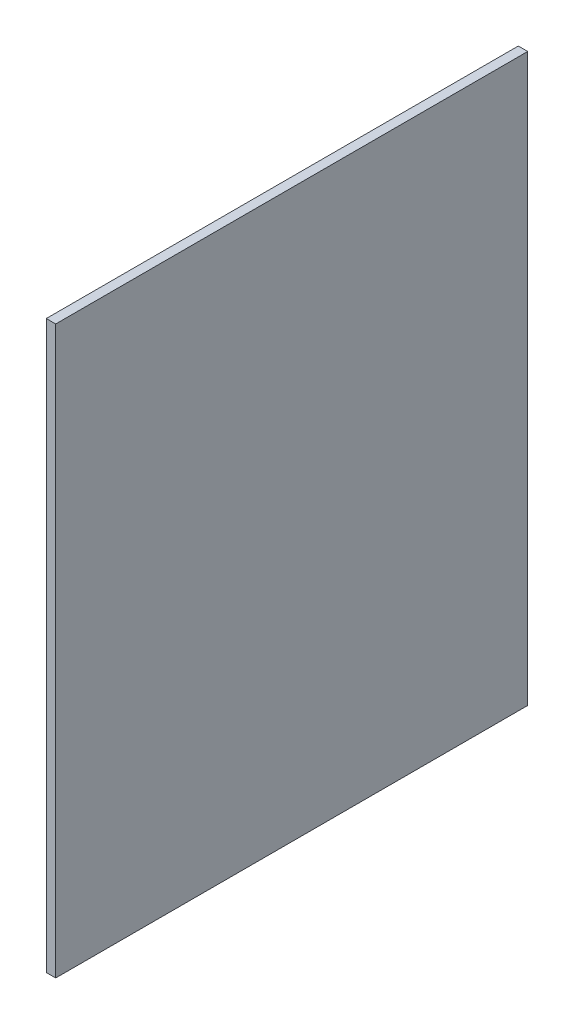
from build123d import *

# Parameters (mm, degrees)
ESQUISSE1_W      = 6
ESQUISSE1_H      = 360
EXTRUSION1_DEPTH = 300


with BuildPart() as part:
    # Esquisse1 → Extrusion1 (new body)
    with BuildSketch(Plane.XY):
        with Locations((-47.537530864, 119.731640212)):
            Rectangle(ESQUISSE1_W, ESQUISSE1_H)
    extrude(amount=EXTRUSION1_DEPTH)


solid = part.part
